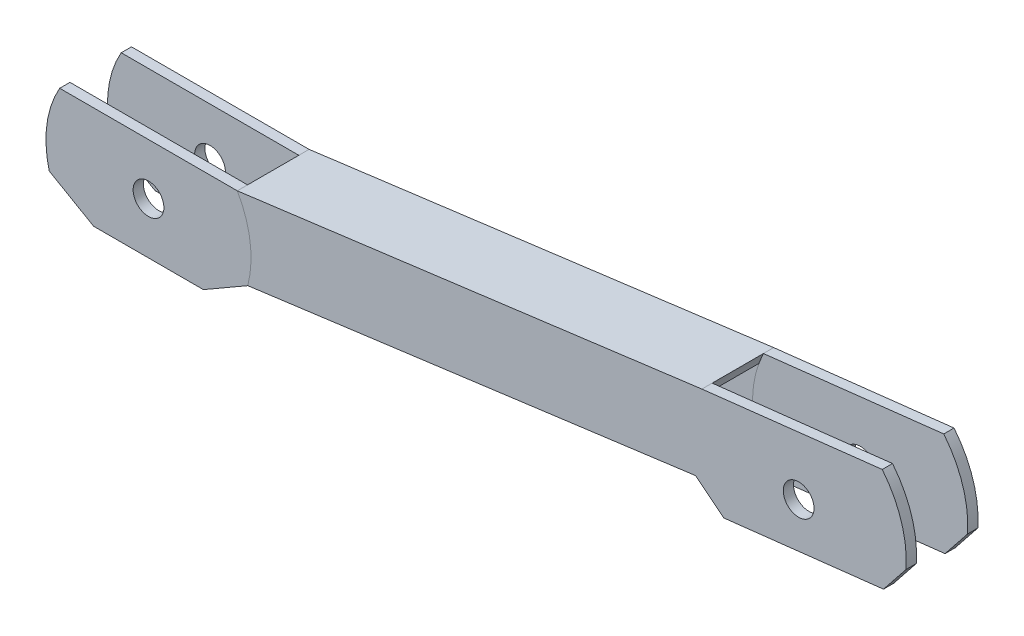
ISO-10303-21;
HEADER;
FILE_DESCRIPTION(('STEP AP214'),'2;1');
FILE_NAME('part.step','',(''),(''),'','','');
FILE_SCHEMA(('AUTOMOTIVE_DESIGN { 1 0 10303 214 1 1 1 1 }'));
ENDSEC;
DATA;
#1=APPLICATION_CONTEXT('core data for automotive mechanical design processes');
#2=APPLICATION_PROTOCOL_DEFINITION('international standard','automotive_design',2000,#1);
#3=PRODUCT_CONTEXT('',#1,'mechanical');
#4=PRODUCT('Part','Part','',(#3));
#5=PRODUCT_RELATED_PRODUCT_CATEGORY('part','',(#4));
#6=PRODUCT_DEFINITION_FORMATION('','',#4);
#7=PRODUCT_DEFINITION_CONTEXT('part definition',#1,'design');
#8=PRODUCT_DEFINITION('design','',#6,#7);
#9=PRODUCT_DEFINITION_SHAPE('','',#8);
#10=(LENGTH_UNIT() NAMED_UNIT(*) SI_UNIT(.MILLI.,.METRE.));
#11=(NAMED_UNIT(*) PLANE_ANGLE_UNIT() SI_UNIT($,.RADIAN.));
#12=(NAMED_UNIT(*) SI_UNIT($,.STERADIAN.) SOLID_ANGLE_UNIT());
#13=UNCERTAINTY_MEASURE_WITH_UNIT(LENGTH_MEASURE(1.E-05),#10,'distance_accuracy_value','');
#14=(GEOMETRIC_REPRESENTATION_CONTEXT(3) GLOBAL_UNCERTAINTY_ASSIGNED_CONTEXT((#13)) GLOBAL_UNIT_ASSIGNED_CONTEXT((#10,
#11,#12)) REPRESENTATION_CONTEXT('',''));
#15=CARTESIAN_POINT('',(0.,0.,0.));
#16=DIRECTION('',(0.,0.,1.));
#17=DIRECTION('',(1.,0.,0.));
#18=AXIS2_PLACEMENT_3D('',#15,#16,#17);
#19=CARTESIAN_POINT('',(634.,63.,35.));
#20=DIRECTION('',(0.,0.,-1.));
#21=DIRECTION('',(-1.,0.,0.));
#22=AXIS2_PLACEMENT_3D('',#19,#20,#21);
#23=CYLINDRICAL_SURFACE('',#22,105.);
#24=CARTESIAN_POINT('',(634.,63.,-25.));
#25=DIRECTION('',(0.,0.,1.));
#26=DIRECTION('',(1.,0.,0.));
#27=AXIS2_PLACEMENT_3D('',#24,#25,#26);
#28=CIRCLE('',#27,105.);
#29=CARTESIAN_POINT('',(539.670102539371,109.118005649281,-25.));
#30=VERTEX_POINT('',#29);
#31=CARTESIAN_POINT('',(533.401265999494,32.9185319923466,-25.));
#32=VERTEX_POINT('',#31);
#33=EDGE_CURVE('E74',#30,#32,#28,.T.);
#34=ORIENTED_EDGE('',*,*,#33,.F.);
#35=DIRECTION('',(0.,0.,-1.));
#36=VECTOR('',#35,1.);
#37=CARTESIAN_POINT('',(539.670102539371,109.118005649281,35.));
#38=LINE('',#37,#36);
#39=CARTESIAN_POINT('',(539.670102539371,109.118005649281,-35.));
#40=VERTEX_POINT('',#39);
#41=EDGE_CURVE('E48',#30,#40,#38,.T.);
#42=ORIENTED_EDGE('',*,*,#41,.T.);
#43=CARTESIAN_POINT('',(634.,63.,-35.));
#44=DIRECTION('',(0.,0.,1.));
#45=DIRECTION('',(1.,0.,0.));
#46=AXIS2_PLACEMENT_3D('',#43,#44,#45);
#47=CIRCLE('',#46,105.);
#48=CARTESIAN_POINT('',(533.401265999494,32.9185319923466,-35.));
#49=VERTEX_POINT('',#48);
#50=EDGE_CURVE('E112',#40,#49,#47,.T.);
#51=ORIENTED_EDGE('',*,*,#50,.T.);
#52=DIRECTION('',(0.,0.,-1.));
#53=VECTOR('',#52,1.);
#54=CARTESIAN_POINT('',(533.401265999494,32.9185319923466,35.));
#55=LINE('',#54,#53);
#56=EDGE_CURVE('E104',#32,#49,#55,.T.);
#57=ORIENTED_EDGE('',*,*,#56,.F.);
#58=EDGE_LOOP('',(#34,#42,#51,#57));
#59=FACE_BOUND('',#58,.T.);
#60=ADVANCED_FACE('F44',(#59),#23,.T.);
#61=CARTESIAN_POINT('',(533.401265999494,32.9185319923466,35.));
#62=DIRECTION('',(0.622514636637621,0.782608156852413,0.));
#63=DIRECTION('',(-0.782608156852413,0.622514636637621,0.));
#64=AXIS2_PLACEMENT_3D('',#61,#62,#63);
#65=PLANE('',#64);
#66=DIRECTION('',(0.782608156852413,-0.622514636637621,0.));
#67=VECTOR('',#66,1.);
#68=CARTESIAN_POINT('',(533.401265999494,32.9185319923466,-25.));
#69=LINE('',#68,#67);
#70=CARTESIAN_POINT('',(561.070642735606,10.9093159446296,-25.));
#71=VERTEX_POINT('',#70);
#72=EDGE_CURVE('E109',#32,#71,#69,.T.);
#73=ORIENTED_EDGE('',*,*,#72,.F.);
#74=ORIENTED_EDGE('',*,*,#56,.T.);
#75=DIRECTION('',(0.782608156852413,-0.622514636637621,0.));
#76=VECTOR('',#75,1.);
#77=CARTESIAN_POINT('',(533.401265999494,32.9185319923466,-35.));
#78=LINE('',#77,#76);
#79=CARTESIAN_POINT('',(561.070642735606,10.9093159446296,-35.));
#80=VERTEX_POINT('',#79);
#81=EDGE_CURVE('E107',#49,#80,#78,.T.);
#82=ORIENTED_EDGE('',*,*,#81,.T.);
#83=DIRECTION('',(0.,0.,-1.));
#84=VECTOR('',#83,1.);
#85=CARTESIAN_POINT('',(561.070642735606,10.9093159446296,35.));
#86=LINE('',#85,#84);
#87=EDGE_CURVE('E99',#71,#80,#86,.T.);
#88=ORIENTED_EDGE('',*,*,#87,.F.);
#89=EDGE_LOOP('',(#73,#74,#82,#88));
#90=FACE_BOUND('',#89,.T.);
#91=ADVANCED_FACE('F106',(#90),#65,.F.);
#92=CARTESIAN_POINT('',(561.070642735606,10.9093159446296,35.));
#93=DIRECTION('',(-0.113203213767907,0.993571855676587,0.));
#94=DIRECTION('',(-0.993571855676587,-0.113203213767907,0.));
#95=AXIS2_PLACEMENT_3D('',#92,#93,#94);
#96=PLANE('',#95);
#97=DIRECTION('',(0.993571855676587,0.113203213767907,0.));
#98=VECTOR('',#97,1.);
#99=CARTESIAN_POINT('',(561.070642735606,10.9093159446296,-25.));
#100=LINE('',#99,#98);
#101=CARTESIAN_POINT('',(716.778036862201,28.6499326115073,-25.));
#102=VERTEX_POINT('',#101);
#103=EDGE_CURVE('E54',#71,#102,#100,.T.);
#104=ORIENTED_EDGE('',*,*,#103,.F.);
#105=ORIENTED_EDGE('',*,*,#87,.T.);
#106=DIRECTION('',(0.993571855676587,0.113203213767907,0.));
#107=VECTOR('',#106,1.);
#108=CARTESIAN_POINT('',(561.070642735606,10.9093159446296,-35.));
#109=LINE('',#108,#107);
#110=CARTESIAN_POINT('',(716.778036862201,28.6499326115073,-35.));
#111=VERTEX_POINT('',#110);
#112=EDGE_CURVE('E120',#80,#111,#109,.T.);
#113=ORIENTED_EDGE('',*,*,#112,.T.);
#114=DIRECTION('',(0.,0.,-1.));
#115=VECTOR('',#114,1.);
#116=CARTESIAN_POINT('',(716.778036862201,28.6499326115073,35.));
#117=LINE('',#116,#115);
#118=EDGE_CURVE('E137',#102,#111,#117,.T.);
#119=ORIENTED_EDGE('',*,*,#118,.F.);
#120=EDGE_LOOP('',(#104,#105,#113,#119));
#121=FACE_BOUND('',#120,.T.);
#122=ADVANCED_FACE('F155',(#121),#96,.F.);
#123=CARTESIAN_POINT('',(738.787252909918,56.3193093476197,35.));
#124=DIRECTION('',(-0.782608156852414,0.622514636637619,0.));
#125=DIRECTION('',(-0.622514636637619,-0.782608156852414,0.));
#126=AXIS2_PLACEMENT_3D('',#123,#124,#125);
#127=PLANE('',#126);
#128=DIRECTION('',(0.622514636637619,0.782608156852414,0.));
#129=VECTOR('',#128,1.);
#130=CARTESIAN_POINT('',(716.778036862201,28.6499326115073,-25.));
#131=LINE('',#130,#129);
#132=CARTESIAN_POINT('',(738.787252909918,56.3193093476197,-25.));
#133=VERTEX_POINT('',#132);
#134=EDGE_CURVE('E12',#102,#133,#131,.T.);
#135=ORIENTED_EDGE('',*,*,#134,.F.);
#136=ORIENTED_EDGE('',*,*,#118,.T.);
#137=DIRECTION('',(0.622514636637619,0.782608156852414,0.));
#138=VECTOR('',#137,1.);
#139=CARTESIAN_POINT('',(738.787252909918,56.3193093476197,-35.));
#140=LINE('',#139,#138);
#141=CARTESIAN_POINT('',(738.787252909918,56.3193093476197,-35.));
#142=VERTEX_POINT('',#141);
#143=EDGE_CURVE('E139',#111,#142,#140,.T.);
#144=ORIENTED_EDGE('',*,*,#143,.T.);
#145=DIRECTION('',(0.,0.,-1.));
#146=VECTOR('',#145,1.);
#147=CARTESIAN_POINT('',(738.787252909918,56.3193093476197,35.));
#148=LINE('',#147,#146);
#149=EDGE_CURVE('E140',#133,#142,#148,.T.);
#150=ORIENTED_EDGE('',*,*,#149,.F.);
#151=EDGE_LOOP('',(#135,#136,#144,#150));
#152=FACE_BOUND('',#151,.T.);
#153=ADVANCED_FACE('F158',(#152),#127,.F.);
#154=CARTESIAN_POINT('',(634.,63.,35.));
#155=DIRECTION('',(0.,0.,-1.));
#156=DIRECTION('',(-1.,0.,0.));
#157=AXIS2_PLACEMENT_3D('',#154,#155,#156);
#158=CYLINDRICAL_SURFACE('',#157,105.);
#159=CARTESIAN_POINT('',(634.,63.,-25.));
#160=DIRECTION('',(0.,0.,1.));
#161=DIRECTION('',(1.,0.,0.));
#162=AXIS2_PLACEMENT_3D('',#159,#160,#161);
#163=CIRCLE('',#162,105.);
#164=CARTESIAN_POINT('',(715.537934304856,129.155614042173,-25.));
#165=VERTEX_POINT('',#164);
#166=EDGE_CURVE('E81',#133,#165,#163,.T.);
#167=ORIENTED_EDGE('',*,*,#166,.F.);
#168=ORIENTED_EDGE('',*,*,#149,.T.);
#169=CARTESIAN_POINT('',(634.,63.,-35.));
#170=DIRECTION('',(0.,0.,1.));
#171=DIRECTION('',(1.,0.,0.));
#172=AXIS2_PLACEMENT_3D('',#169,#170,#171);
#173=CIRCLE('',#172,105.);
#174=CARTESIAN_POINT('',(715.537934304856,129.155614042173,-35.));
#175=VERTEX_POINT('',#174);
#176=EDGE_CURVE('E141',#142,#175,#173,.T.);
#177=ORIENTED_EDGE('',*,*,#176,.T.);
#178=DIRECTION('',(0.,0.,-1.));
#179=VECTOR('',#178,1.);
#180=CARTESIAN_POINT('',(715.537934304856,129.155614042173,35.));
#181=LINE('',#180,#179);
#182=EDGE_CURVE('E142',#165,#175,#181,.T.);
#183=ORIENTED_EDGE('',*,*,#182,.F.);
#184=EDGE_LOOP('',(#167,#168,#177,#183));
#185=FACE_BOUND('',#184,.T.);
#186=ADVANCED_FACE('F159',(#185),#158,.T.);
#187=CARTESIAN_POINT('',(539.670102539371,109.118005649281,35.));
#188=DIRECTION('',(0.113203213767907,-0.993571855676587,0.));
#189=DIRECTION('',(0.993571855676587,0.113203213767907,0.));
#190=AXIS2_PLACEMENT_3D('',#187,#188,#189);
#191=PLANE('',#190);
#192=DIRECTION('',(-0.993571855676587,-0.113203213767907,0.));
#193=VECTOR('',#192,1.);
#194=CARTESIAN_POINT('',(715.537934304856,129.155614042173,-25.));
#195=LINE('',#194,#193);
#196=EDGE_CURVE('E78',#165,#30,#195,.T.);
#197=ORIENTED_EDGE('',*,*,#196,.F.);
#198=ORIENTED_EDGE('',*,*,#182,.T.);
#199=DIRECTION('',(-0.993571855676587,-0.113203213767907,0.));
#200=VECTOR('',#199,1.);
#201=CARTESIAN_POINT('',(539.670102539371,109.118005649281,-35.));
#202=LINE('',#201,#200);
#203=EDGE_CURVE('E143',#175,#40,#202,.T.);
#204=ORIENTED_EDGE('',*,*,#203,.T.);
#205=ORIENTED_EDGE('',*,*,#41,.F.);
#206=EDGE_LOOP('',(#197,#198,#204,#205));
#207=FACE_BOUND('',#206,.T.);
#208=ADVANCED_FACE('F161',(#207),#191,.F.);
#209=CARTESIAN_POINT('',(634.,63.,35.));
#210=DIRECTION('',(0.,0.,-1.));
#211=DIRECTION('',(-1.,0.,0.));
#212=AXIS2_PLACEMENT_3D('',#209,#210,#211);
#213=CYLINDRICAL_SURFACE('',#212,15.);
#214=CARTESIAN_POINT('',(634.,63.,-35.));
#215=DIRECTION('',(0.,0.,1.));
#216=DIRECTION('',(1.,0.,0.));
#217=AXIS2_PLACEMENT_3D('',#214,#215,#216);
#218=CIRCLE('',#217,15.);
#219=CARTESIAN_POINT('',(649.,63.,-35.));
#220=VERTEX_POINT('',#219);
#221=EDGE_CURVE('E127',#220,#220,#218,.T.);
#222=ORIENTED_EDGE('',*,*,#221,.F.);
#223=EDGE_LOOP('',(#222));
#224=FACE_BOUND('',#223,.T.);
#225=CARTESIAN_POINT('',(634.,63.,-25.));
#226=DIRECTION('',(0.,0.,1.));
#227=DIRECTION('',(1.,0.,0.));
#228=AXIS2_PLACEMENT_3D('',#225,#226,#227);
#229=CIRCLE('',#228,15.);
#230=CARTESIAN_POINT('',(649.,63.,-25.));
#231=VERTEX_POINT('',#230);
#232=EDGE_CURVE('E129',#231,#231,#229,.T.);
#233=ORIENTED_EDGE('',*,*,#232,.T.);
#234=EDGE_LOOP('',(#233));
#235=FACE_BOUND('',#234,.T.);
#236=ADVANCED_FACE('F46',(#224,#235),#213,.F.);
#237=CARTESIAN_POINT('',(634.,63.,-35.));
#238=DIRECTION('',(0.,0.,1.));
#239=DIRECTION('',(1.,0.,0.));
#240=AXIS2_PLACEMENT_3D('',#237,#238,#239);
#241=PLANE('',#240);
#242=ORIENTED_EDGE('',*,*,#50,.F.);
#243=ORIENTED_EDGE('',*,*,#203,.F.);
#244=ORIENTED_EDGE('',*,*,#176,.F.);
#245=ORIENTED_EDGE('',*,*,#143,.F.);
#246=ORIENTED_EDGE('',*,*,#112,.F.);
#247=ORIENTED_EDGE('',*,*,#81,.F.);
#248=EDGE_LOOP('',(#242,#243,#244,#245,#246,#247));
#249=FACE_BOUND('',#248,.T.);
#250=ORIENTED_EDGE('',*,*,#221,.T.);
#251=EDGE_LOOP('',(#250));
#252=FACE_BOUND('',#251,.T.);
#253=ADVANCED_FACE('F116',(#249,#252),#241,.F.);
#254=CARTESIAN_POINT('',(634.,63.,-25.));
#255=DIRECTION('',(0.,0.,1.));
#256=DIRECTION('',(1.,0.,0.));
#257=AXIS2_PLACEMENT_3D('',#254,#255,#256);
#258=PLANE('',#257);
#259=ORIENTED_EDGE('',*,*,#232,.F.);
#260=EDGE_LOOP('',(#259));
#261=FACE_BOUND('',#260,.T.);
#262=ORIENTED_EDGE('',*,*,#166,.T.);
#263=ORIENTED_EDGE('',*,*,#196,.T.);
#264=ORIENTED_EDGE('',*,*,#33,.T.);
#265=ORIENTED_EDGE('',*,*,#72,.T.);
#266=ORIENTED_EDGE('',*,*,#103,.T.);
#267=ORIENTED_EDGE('',*,*,#134,.T.);
#268=EDGE_LOOP('',(#262,#263,#264,#265,#266,#267));
#269=FACE_BOUND('',#268,.T.);
#270=ADVANCED_FACE('F211',(#261,#269),#258,.T.);
#271=CLOSED_SHELL('',(#60,#91,#122,#153,#186,#208,#236,#253,#270));
#272=MANIFOLD_SOLID_BREP('B2',#271);
#273=CARTESIAN_POINT('',(91.4126657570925,40.5428728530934,35.));
#274=DIRECTION('',(-0.129387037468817,0.991594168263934,0.));
#275=DIRECTION('',(-0.991594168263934,-0.129387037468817,0.));
#276=AXIS2_PLACEMENT_3D('',#273,#274,#275);
#277=PLANE('',#276);
#278=DIRECTION('',(-0.991594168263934,-0.129387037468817,0.));
#279=VECTOR('',#278,1.);
#280=CARTESIAN_POINT('',(91.4126657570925,40.5428728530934,-25.));
#281=LINE('',#280,#279);
#282=CARTESIAN_POINT('',(535.163583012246,98.445206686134,-25.));
#283=VERTEX_POINT('',#282);
#284=CARTESIAN_POINT('',(91.4126657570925,40.5428728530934,-25.));
#285=VERTEX_POINT('',#284);
#286=EDGE_CURVE('E319',#283,#285,#281,.T.);
#287=ORIENTED_EDGE('',*,*,#286,.F.);
#288=DIRECTION('',(0.,0.,-1.));
#289=VECTOR('',#288,1.);
#290=CARTESIAN_POINT('',(535.163583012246,98.445206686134,35.));
#291=LINE('',#290,#289);
#292=CARTESIAN_POINT('',(535.163583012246,98.445206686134,25.));
#293=VERTEX_POINT('',#292);
#294=EDGE_CURVE('E409',#293,#283,#291,.T.);
#295=ORIENTED_EDGE('',*,*,#294,.F.);
#296=DIRECTION('',(0.991594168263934,0.129387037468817,0.));
#297=VECTOR('',#296,1.);
#298=CARTESIAN_POINT('',(91.4126657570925,40.5428728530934,25.));
#299=LINE('',#298,#297);
#300=CARTESIAN_POINT('',(91.4126657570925,40.5428728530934,25.));
#301=VERTEX_POINT('',#300);
#302=EDGE_CURVE('E267',#301,#293,#299,.T.);
#303=ORIENTED_EDGE('',*,*,#302,.F.);
#304=DIRECTION('',(0.,0.,-1.));
#305=VECTOR('',#304,1.);
#306=CARTESIAN_POINT('',(91.4126657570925,40.5428728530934,35.));
#307=LINE('',#306,#305);
#308=EDGE_CURVE('E489',#301,#285,#307,.T.);
#309=ORIENTED_EDGE('',*,*,#308,.T.);
#310=EDGE_LOOP('',(#287,#295,#303,#309));
#311=FACE_BOUND('',#310,.T.);
#312=ADVANCED_FACE('F250',(#311),#277,.F.);
#313=CARTESIAN_POINT('',(634.,63.,35.));
#314=DIRECTION('',(0.,0.,-1.));
#315=DIRECTION('',(-1.,0.,0.));
#316=AXIS2_PLACEMENT_3D('',#313,#314,#315);
#317=CYLINDRICAL_SURFACE('',#316,105.);
#318=CARTESIAN_POINT('',(634.,63.,-35.));
#319=DIRECTION('',(0.,0.,-1.));
#320=DIRECTION('',(1.,0.,0.));
#321=AXIS2_PLACEMENT_3D('',#318,#319,#320);
#322=CIRCLE('',#321,105.);
#323=CARTESIAN_POINT('',(533.401265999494,32.9185319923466,-35.));
#324=VERTEX_POINT('',#323);
#325=CARTESIAN_POINT('',(539.670102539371,109.118005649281,-35.));
#326=VERTEX_POINT('',#325);
#327=EDGE_CURVE('E472',#324,#326,#322,.T.);
#328=ORIENTED_EDGE('',*,*,#327,.T.);
#329=DIRECTION('',(0.,0.,-1.));
#330=VECTOR('',#329,1.);
#331=CARTESIAN_POINT('',(539.670102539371,109.118005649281,35.));
#332=LINE('',#331,#330);
#333=CARTESIAN_POINT('',(539.670102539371,109.118005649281,25.));
#334=VERTEX_POINT('',#333);
#335=EDGE_CURVE('E484',#334,#326,#332,.T.);
#336=ORIENTED_EDGE('',*,*,#335,.F.);
#337=CARTESIAN_POINT('',(634.,63.,25.));
#338=DIRECTION('',(0.,0.,1.));
#339=DIRECTION('',(1.,0.,0.));
#340=AXIS2_PLACEMENT_3D('',#337,#338,#339);
#341=CIRCLE('',#340,105.);
#342=EDGE_CURVE('E432',#334,#293,#341,.T.);
#343=ORIENTED_EDGE('',*,*,#342,.T.);
#344=ORIENTED_EDGE('',*,*,#294,.T.);
#345=CARTESIAN_POINT('',(634.,63.,-25.));
#346=DIRECTION('',(0.,0.,-1.));
#347=DIRECTION('',(1.,0.,0.));
#348=AXIS2_PLACEMENT_3D('',#345,#346,#347);
#349=CIRCLE('',#348,105.);
#350=CARTESIAN_POINT('',(533.401265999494,32.9185319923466,-25.));
#351=VERTEX_POINT('',#350);
#352=EDGE_CURVE('E392',#351,#283,#349,.T.);
#353=ORIENTED_EDGE('',*,*,#352,.F.);
#354=DIRECTION('',(0.,0.,-1.));
#355=VECTOR('',#354,1.);
#356=CARTESIAN_POINT('',(533.401265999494,32.9185319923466,-25.));
#357=LINE('',#356,#355);
#358=EDGE_CURVE('E398',#351,#324,#357,.T.);
#359=ORIENTED_EDGE('',*,*,#358,.T.);
#360=EDGE_LOOP('',(#328,#336,#343,#344,#353,#359));
#361=FACE_BOUND('',#360,.T.);
#362=ADVANCED_FACE('F408',(#361),#317,.F.);
#363=CARTESIAN_POINT('',(-86.6025403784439,50.,35.));
#364=DIRECTION('',(0.,-1.,0.));
#365=DIRECTION('',(0.,0.,-1.));
#366=AXIS2_PLACEMENT_3D('',#363,#364,#365);
#367=PLANE('',#366);
#368=DIRECTION('',(-1.,0.,0.));
#369=VECTOR('',#368,1.);
#370=CARTESIAN_POINT('',(-86.6025403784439,50.,-25.));
#371=LINE('',#370,#369);
#372=CARTESIAN_POINT('',(86.6025403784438,50.,-25.));
#373=VERTEX_POINT('',#372);
#374=CARTESIAN_POINT('',(-86.6025403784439,50.,-25.));
#375=VERTEX_POINT('',#374);
#376=EDGE_CURVE('E42',#373,#375,#371,.T.);
#377=ORIENTED_EDGE('',*,*,#376,.F.);
#378=DIRECTION('',(0.,0.,-1.));
#379=VECTOR('',#378,1.);
#380=CARTESIAN_POINT('',(86.6025403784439,50.,35.));
#381=LINE('',#380,#379);
#382=CARTESIAN_POINT('',(86.6025403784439,50.,-35.));
#383=VERTEX_POINT('',#382);
#384=EDGE_CURVE('E506',#373,#383,#381,.T.);
#385=ORIENTED_EDGE('',*,*,#384,.T.);
#386=DIRECTION('',(-1.,0.,0.));
#387=VECTOR('',#386,1.);
#388=CARTESIAN_POINT('',(-86.6025403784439,50.,-35.));
#389=LINE('',#388,#387);
#390=CARTESIAN_POINT('',(-86.6025403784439,50.,-35.));
#391=VERTEX_POINT('',#390);
#392=EDGE_CURVE('E504',#383,#391,#389,.T.);
#393=ORIENTED_EDGE('',*,*,#392,.T.);
#394=DIRECTION('',(0.,0.,-1.));
#395=VECTOR('',#394,1.);
#396=CARTESIAN_POINT('',(-86.6025403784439,50.,35.));
#397=LINE('',#396,#395);
#398=EDGE_CURVE('E313',#375,#391,#397,.T.);
#399=ORIENTED_EDGE('',*,*,#398,.F.);
#400=EDGE_LOOP('',(#377,#385,#393,#399));
#401=FACE_BOUND('',#400,.T.);
#402=ADVANCED_FACE('F537',(#401),#367,.F.);
#403=CARTESIAN_POINT('',(0.,0.,35.));
#404=DIRECTION('',(0.,0.,-1.));
#405=DIRECTION('',(-1.,0.,0.));
#406=AXIS2_PLACEMENT_3D('',#403,#404,#405);
#407=CYLINDRICAL_SURFACE('',#406,100.);
#408=CARTESIAN_POINT('',(0.,0.,-25.));
#409=DIRECTION('',(0.,0.,1.));
#410=DIRECTION('',(1.,0.,0.));
#411=AXIS2_PLACEMENT_3D('',#408,#409,#410);
#412=CIRCLE('',#411,100.);
#413=CARTESIAN_POINT('',(-96.8245836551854,-25.,-25.));
#414=VERTEX_POINT('',#413);
#415=EDGE_CURVE('E287',#375,#414,#412,.T.);
#416=ORIENTED_EDGE('',*,*,#415,.F.);
#417=ORIENTED_EDGE('',*,*,#398,.T.);
#418=CARTESIAN_POINT('',(0.,0.,-35.));
#419=DIRECTION('',(0.,0.,1.));
#420=DIRECTION('',(1.,0.,0.));
#421=AXIS2_PLACEMENT_3D('',#418,#419,#420);
#422=CIRCLE('',#421,100.);
#423=CARTESIAN_POINT('',(-96.8245836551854,-25.,-35.));
#424=VERTEX_POINT('',#423);
#425=EDGE_CURVE('E502',#391,#424,#422,.T.);
#426=ORIENTED_EDGE('',*,*,#425,.T.);
#427=DIRECTION('',(0.,0.,-1.));
#428=VECTOR('',#427,1.);
#429=CARTESIAN_POINT('',(-96.8245836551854,-25.,35.));
#430=LINE('',#429,#428);
#431=EDGE_CURVE('E307',#414,#424,#430,.T.);
#432=ORIENTED_EDGE('',*,*,#431,.F.);
#433=EDGE_LOOP('',(#416,#417,#426,#432));
#434=FACE_BOUND('',#433,.T.);
#435=ADVANCED_FACE('F533',(#434),#407,.T.);
#436=CARTESIAN_POINT('',(-96.8245836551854,-25.,35.));
#437=DIRECTION('',(0.499999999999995,0.866025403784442,0.));
#438=DIRECTION('',(-0.866025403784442,0.499999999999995,0.));
#439=AXIS2_PLACEMENT_3D('',#436,#437,#438);
#440=PLANE('',#439);
#441=DIRECTION('',(0.866025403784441,-0.499999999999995,0.));
#442=VECTOR('',#441,1.);
#443=CARTESIAN_POINT('',(-96.8245836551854,-25.,-25.));
#444=LINE('',#443,#442);
#445=CARTESIAN_POINT('',(-53.5233134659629,-50.,-25.));
#446=VERTEX_POINT('',#445);
#447=EDGE_CURVE('E513',#414,#446,#444,.T.);
#448=ORIENTED_EDGE('',*,*,#447,.F.);
#449=ORIENTED_EDGE('',*,*,#431,.T.);
#450=DIRECTION('',(0.866025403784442,-0.499999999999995,0.));
#451=VECTOR('',#450,1.);
#452=CARTESIAN_POINT('',(-96.8245836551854,-25.,-35.));
#453=LINE('',#452,#451);
#454=CARTESIAN_POINT('',(-53.5233134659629,-50.,-35.));
#455=VERTEX_POINT('',#454);
#456=EDGE_CURVE('E500',#424,#455,#453,.T.);
#457=ORIENTED_EDGE('',*,*,#456,.T.);
#458=DIRECTION('',(0.,0.,-1.));
#459=VECTOR('',#458,1.);
#460=CARTESIAN_POINT('',(-53.5233134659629,-50.,35.));
#461=LINE('',#460,#459);
#462=EDGE_CURVE('E499',#446,#455,#461,.T.);
#463=ORIENTED_EDGE('',*,*,#462,.F.);
#464=EDGE_LOOP('',(#448,#449,#457,#463));
#465=FACE_BOUND('',#464,.T.);
#466=ADVANCED_FACE('F527',(#465),#440,.F.);
#467=CARTESIAN_POINT('',(-53.5233134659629,-50.,35.));
#468=DIRECTION('',(0.,1.,0.));
#469=DIRECTION('',(0.,0.,1.));
#470=AXIS2_PLACEMENT_3D('',#467,#468,#469);
#471=PLANE('',#470);
#472=DIRECTION('',(1.,0.,0.));
#473=VECTOR('',#472,1.);
#474=CARTESIAN_POINT('',(-53.5233134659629,-50.,-25.));
#475=LINE('',#474,#473);
#476=CARTESIAN_POINT('',(53.5233134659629,-50.,-25.));
#477=VERTEX_POINT('',#476);
#478=EDGE_CURVE('E511',#446,#477,#475,.T.);
#479=ORIENTED_EDGE('',*,*,#478,.F.);
#480=ORIENTED_EDGE('',*,*,#462,.T.);
#481=DIRECTION('',(1.,0.,0.));
#482=VECTOR('',#481,1.);
#483=CARTESIAN_POINT('',(-53.5233134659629,-50.,-35.));
#484=LINE('',#483,#482);
#485=CARTESIAN_POINT('',(53.5233134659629,-50.,-35.));
#486=VERTEX_POINT('',#485);
#487=EDGE_CURVE('E497',#455,#486,#484,.T.);
#488=ORIENTED_EDGE('',*,*,#487,.T.);
#489=DIRECTION('',(0.,0.,-1.));
#490=VECTOR('',#489,1.);
#491=CARTESIAN_POINT('',(53.5233134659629,-50.,35.));
#492=LINE('',#491,#490);
#493=EDGE_CURVE('E296',#477,#486,#492,.T.);
#494=ORIENTED_EDGE('',*,*,#493,.F.);
#495=EDGE_LOOP('',(#479,#480,#488,#494));
#496=FACE_BOUND('',#495,.T.);
#497=ADVANCED_FACE('F523',(#496),#471,.F.);
#498=CARTESIAN_POINT('',(96.8245836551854,-25.,35.));
#499=DIRECTION('',(-0.499999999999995,0.866025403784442,0.));
#500=DIRECTION('',(-0.866025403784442,-0.499999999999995,0.));
#501=AXIS2_PLACEMENT_3D('',#498,#499,#500);
#502=PLANE('',#501);
#503=DIRECTION('',(0.866025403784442,0.499999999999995,0.));
#504=VECTOR('',#503,1.);
#505=CARTESIAN_POINT('',(53.5233134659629,-50.,-25.));
#506=LINE('',#505,#504);
#507=CARTESIAN_POINT('',(96.8245836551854,-25.,-25.));
#508=VERTEX_POINT('',#507);
#509=EDGE_CURVE('E394',#477,#508,#506,.T.);
#510=ORIENTED_EDGE('',*,*,#509,.F.);
#511=ORIENTED_EDGE('',*,*,#493,.T.);
#512=DIRECTION('',(0.866025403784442,0.499999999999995,0.));
#513=VECTOR('',#512,1.);
#514=CARTESIAN_POINT('',(96.8245836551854,-25.,-35.));
#515=LINE('',#514,#513);
#516=CARTESIAN_POINT('',(96.8245836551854,-25.,-35.));
#517=VERTEX_POINT('',#516);
#518=EDGE_CURVE('E495',#486,#517,#515,.T.);
#519=ORIENTED_EDGE('',*,*,#518,.T.);
#520=DIRECTION('',(0.,0.,-1.));
#521=VECTOR('',#520,1.);
#522=CARTESIAN_POINT('',(96.8245836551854,-25.,35.));
#523=LINE('',#522,#521);
#524=EDGE_CURVE('E254',#508,#517,#523,.T.);
#525=ORIENTED_EDGE('',*,*,#524,.F.);
#526=EDGE_LOOP('',(#510,#511,#519,#525));
#527=FACE_BOUND('',#526,.T.);
#528=ADVANCED_FACE('F532',(#527),#502,.F.);
#529=CARTESIAN_POINT('',(0.,0.,35.));
#530=DIRECTION('',(0.,0.,-1.));
#531=DIRECTION('',(-1.,0.,0.));
#532=AXIS2_PLACEMENT_3D('',#529,#530,#531);
#533=CYLINDRICAL_SURFACE('',#532,15.);
#534=CARTESIAN_POINT('',(0.,0.,-35.));
#535=DIRECTION('',(0.,0.,1.));
#536=DIRECTION('',(1.,0.,0.));
#537=AXIS2_PLACEMENT_3D('',#534,#535,#536);
#538=CIRCLE('',#537,15.);
#539=CARTESIAN_POINT('',(15.,0.,-35.));
#540=VERTEX_POINT('',#539);
#541=EDGE_CURVE('E494',#540,#540,#538,.T.);
#542=ORIENTED_EDGE('',*,*,#541,.F.);
#543=EDGE_LOOP('',(#542));
#544=FACE_BOUND('',#543,.T.);
#545=CARTESIAN_POINT('',(0.,0.,-25.));
#546=DIRECTION('',(0.,0.,1.));
#547=DIRECTION('',(1.,0.,0.));
#548=AXIS2_PLACEMENT_3D('',#545,#546,#547);
#549=CIRCLE('',#548,15.);
#550=CARTESIAN_POINT('',(15.,0.,-25.));
#551=VERTEX_POINT('',#550);
#552=EDGE_CURVE('E491',#551,#551,#549,.T.);
#553=ORIENTED_EDGE('',*,*,#552,.T.);
#554=EDGE_LOOP('',(#553));
#555=FACE_BOUND('',#554,.T.);
#556=ADVANCED_FACE('F252',(#544,#555),#533,.F.);
#557=CARTESIAN_POINT('',(0.,0.,-35.));
#558=DIRECTION('',(0.,0.,1.));
#559=DIRECTION('',(1.,0.,0.));
#560=AXIS2_PLACEMENT_3D('',#557,#558,#559);
#561=PLANE('',#560);
#562=ORIENTED_EDGE('',*,*,#327,.F.);
#563=DIRECTION('',(0.991314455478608,0.131512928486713,0.));
#564=VECTOR('',#563,1.);
#565=CARTESIAN_POINT('',(96.8245836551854,-25.,-35.));
#566=LINE('',#565,#564);
#567=EDGE_CURVE('E403',#517,#324,#566,.T.);
#568=ORIENTED_EDGE('',*,*,#567,.F.);
#569=ORIENTED_EDGE('',*,*,#518,.F.);
#570=ORIENTED_EDGE('',*,*,#487,.F.);
#571=ORIENTED_EDGE('',*,*,#456,.F.);
#572=ORIENTED_EDGE('',*,*,#425,.F.);
#573=ORIENTED_EDGE('',*,*,#392,.F.);
#574=DIRECTION('',(-0.991594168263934,-0.129387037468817,0.));
#575=VECTOR('',#574,1.);
#576=CARTESIAN_POINT('',(86.6025403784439,50.,-35.));
#577=LINE('',#576,#575);
#578=EDGE_CURVE('E478',#326,#383,#577,.T.);
#579=ORIENTED_EDGE('',*,*,#578,.F.);
#580=EDGE_LOOP('',(#562,#568,#569,#570,#571,#572,#573,#579));
#581=FACE_BOUND('',#580,.T.);
#582=ORIENTED_EDGE('',*,*,#541,.T.);
#583=EDGE_LOOP('',(#582));
#584=FACE_BOUND('',#583,.T.);
#585=ADVANCED_FACE('F530',(#581,#584),#561,.F.);
#586=CARTESIAN_POINT('',(0.,0.,-25.));
#587=DIRECTION('',(0.,0.,1.));
#588=DIRECTION('',(1.,0.,0.));
#589=AXIS2_PLACEMENT_3D('',#586,#587,#588);
#590=PLANE('',#589);
#591=ORIENTED_EDGE('',*,*,#552,.F.);
#592=EDGE_LOOP('',(#591));
#593=FACE_BOUND('',#592,.T.);
#594=ORIENTED_EDGE('',*,*,#415,.T.);
#595=ORIENTED_EDGE('',*,*,#447,.T.);
#596=ORIENTED_EDGE('',*,*,#478,.T.);
#597=ORIENTED_EDGE('',*,*,#509,.T.);
#598=DIRECTION('',(0.991314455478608,0.131512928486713,0.));
#599=VECTOR('',#598,1.);
#600=CARTESIAN_POINT('',(96.8245836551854,-25.,-25.));
#601=LINE('',#600,#599);
#602=EDGE_CURVE('E388',#508,#351,#601,.T.);
#603=ORIENTED_EDGE('',*,*,#602,.T.);
#604=ORIENTED_EDGE('',*,*,#352,.T.);
#605=ORIENTED_EDGE('',*,*,#286,.T.);
#606=CARTESIAN_POINT('',(0.,0.,-25.));
#607=DIRECTION('',(0.,0.,1.));
#608=DIRECTION('',(1.,0.,0.));
#609=AXIS2_PLACEMENT_3D('',#606,#607,#608);
#610=CIRCLE('',#609,100.);
#611=EDGE_CURVE('E259',#285,#373,#610,.T.);
#612=ORIENTED_EDGE('',*,*,#611,.T.);
#613=ORIENTED_EDGE('',*,*,#376,.T.);
#614=EDGE_LOOP('',(#594,#595,#596,#597,#603,#604,#605,#612,#613));
#615=FACE_BOUND('',#614,.T.);
#616=ADVANCED_FACE('F390',(#593,#615),#590,.T.);
#617=CARTESIAN_POINT('',(0.,0.,35.));
#618=DIRECTION('',(0.,0.,-1.));
#619=DIRECTION('',(-1.,0.,0.));
#620=AXIS2_PLACEMENT_3D('',#617,#618,#619);
#621=CYLINDRICAL_SURFACE('',#620,100.);
#622=DIRECTION('',(0.,0.,-1.));
#623=VECTOR('',#622,1.);
#624=CARTESIAN_POINT('',(86.6025403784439,50.,35.));
#625=LINE('',#624,#623);
#626=CARTESIAN_POINT('',(86.6025403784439,50.,35.));
#627=VERTEX_POINT('',#626);
#628=EDGE_CURVE('E480',#627,#373,#625,.T.);
#629=ORIENTED_EDGE('',*,*,#628,.T.);
#630=ORIENTED_EDGE('',*,*,#611,.F.);
#631=ORIENTED_EDGE('',*,*,#308,.F.);
#632=CARTESIAN_POINT('',(0.,0.,25.));
#633=DIRECTION('',(0.,0.,-1.));
#634=DIRECTION('',(1.,0.,0.));
#635=AXIS2_PLACEMENT_3D('',#632,#633,#634);
#636=CIRCLE('',#635,100.);
#637=CARTESIAN_POINT('',(96.8245836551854,-25.,25.));
#638=VERTEX_POINT('',#637);
#639=EDGE_CURVE('E415',#301,#638,#636,.T.);
#640=ORIENTED_EDGE('',*,*,#639,.T.);
#641=DIRECTION('',(0.,0.,1.));
#642=VECTOR('',#641,1.);
#643=CARTESIAN_POINT('',(96.8245836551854,-25.,25.));
#644=LINE('',#643,#642);
#645=CARTESIAN_POINT('',(96.8245836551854,-25.,35.));
#646=VERTEX_POINT('',#645);
#647=EDGE_CURVE('E420',#638,#646,#644,.T.);
#648=ORIENTED_EDGE('',*,*,#647,.T.);
#649=CARTESIAN_POINT('',(0.,0.,35.));
#650=DIRECTION('',(0.,0.,-1.));
#651=DIRECTION('',(1.,0.,0.));
#652=AXIS2_PLACEMENT_3D('',#649,#650,#651);
#653=CIRCLE('',#652,100.);
#654=EDGE_CURVE('E475',#627,#646,#653,.T.);
#655=ORIENTED_EDGE('',*,*,#654,.F.);
#656=EDGE_LOOP('',(#629,#630,#631,#640,#648,#655));
#657=FACE_BOUND('',#656,.T.);
#658=ADVANCED_FACE('F546',(#657),#621,.F.);
#659=CARTESIAN_POINT('',(86.6025403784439,50.,35.));
#660=DIRECTION('',(0.129387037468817,-0.991594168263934,0.));
#661=DIRECTION('',(0.991594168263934,0.129387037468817,0.));
#662=AXIS2_PLACEMENT_3D('',#659,#660,#661);
#663=PLANE('',#662);
#664=ORIENTED_EDGE('',*,*,#384,.F.);
#665=ORIENTED_EDGE('',*,*,#628,.F.);
#666=DIRECTION('',(-0.991594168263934,-0.129387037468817,0.));
#667=VECTOR('',#666,1.);
#668=CARTESIAN_POINT('',(86.6025403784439,50.,35.));
#669=LINE('',#668,#667);
#670=CARTESIAN_POINT('',(539.670102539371,109.118005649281,35.));
#671=VERTEX_POINT('',#670);
#672=EDGE_CURVE('E477',#671,#627,#669,.T.);
#673=ORIENTED_EDGE('',*,*,#672,.F.);
#674=EDGE_CURVE('E485',#671,#334,#332,.T.);
#675=ORIENTED_EDGE('',*,*,#674,.T.);
#676=ORIENTED_EDGE('',*,*,#335,.T.);
#677=ORIENTED_EDGE('',*,*,#578,.T.);
#678=EDGE_LOOP('',(#664,#665,#673,#675,#676,#677));
#679=FACE_BOUND('',#678,.T.);
#680=ADVANCED_FACE('F541',(#679),#663,.F.);
#681=CARTESIAN_POINT('',(0.,0.,35.));
#682=DIRECTION('',(0.,0.,1.));
#683=DIRECTION('',(1.,0.,0.));
#684=AXIS2_PLACEMENT_3D('',#681,#682,#683);
#685=PLANE('',#684);
#686=DIRECTION('',(-0.993571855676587,-0.113203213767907,0.));
#687=VECTOR('',#686,1.);
#688=CARTESIAN_POINT('',(539.670102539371,109.118005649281,35.));
#689=LINE('',#688,#687);
#690=CARTESIAN_POINT('',(715.537934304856,129.155614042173,35.));
#691=VERTEX_POINT('',#690);
#692=EDGE_CURVE('E455',#691,#671,#689,.T.);
#693=ORIENTED_EDGE('',*,*,#692,.T.);
#694=ORIENTED_EDGE('',*,*,#672,.T.);
#695=ORIENTED_EDGE('',*,*,#654,.T.);
#696=DIRECTION('',(0.991314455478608,0.131512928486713,0.));
#697=VECTOR('',#696,1.);
#698=CARTESIAN_POINT('',(96.8245836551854,-25.,35.));
#699=LINE('',#698,#697);
#700=CARTESIAN_POINT('',(533.401265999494,32.9185319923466,35.));
#701=VERTEX_POINT('',#700);
#702=EDGE_CURVE('E414',#646,#701,#699,.T.);
#703=ORIENTED_EDGE('',*,*,#702,.T.);
#704=DIRECTION('',(0.782608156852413,-0.622514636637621,0.));
#705=VECTOR('',#704,1.);
#706=CARTESIAN_POINT('',(533.401265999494,32.9185319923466,35.));
#707=LINE('',#706,#705);
#708=CARTESIAN_POINT('',(561.070642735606,10.9093159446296,35.));
#709=VERTEX_POINT('',#708);
#710=EDGE_CURVE('E447',#701,#709,#707,.T.);
#711=ORIENTED_EDGE('',*,*,#710,.T.);
#712=DIRECTION('',(0.993571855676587,0.113203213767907,0.));
#713=VECTOR('',#712,1.);
#714=CARTESIAN_POINT('',(561.070642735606,10.9093159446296,35.));
#715=LINE('',#714,#713);
#716=CARTESIAN_POINT('',(716.778036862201,28.6499326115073,35.));
#717=VERTEX_POINT('',#716);
#718=EDGE_CURVE('E449',#709,#717,#715,.T.);
#719=ORIENTED_EDGE('',*,*,#718,.T.);
#720=DIRECTION('',(0.622514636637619,0.782608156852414,0.));
#721=VECTOR('',#720,1.);
#722=CARTESIAN_POINT('',(738.787252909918,56.3193093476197,35.));
#723=LINE('',#722,#721);
#724=CARTESIAN_POINT('',(738.787252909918,56.3193093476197,35.));
#725=VERTEX_POINT('',#724);
#726=EDGE_CURVE('E451',#717,#725,#723,.T.);
#727=ORIENTED_EDGE('',*,*,#726,.T.);
#728=CARTESIAN_POINT('',(634.,63.,35.));
#729=DIRECTION('',(0.,0.,1.));
#730=DIRECTION('',(1.,0.,0.));
#731=AXIS2_PLACEMENT_3D('',#728,#729,#730);
#732=CIRCLE('',#731,105.);
#733=EDGE_CURVE('E453',#725,#691,#732,.T.);
#734=ORIENTED_EDGE('',*,*,#733,.T.);
#735=EDGE_LOOP('',(#693,#694,#695,#703,#711,#719,#727,#734));
#736=FACE_BOUND('',#735,.T.);
#737=CARTESIAN_POINT('',(634.,63.,35.));
#738=DIRECTION('',(0.,0.,1.));
#739=DIRECTION('',(1.,0.,0.));
#740=AXIS2_PLACEMENT_3D('',#737,#738,#739);
#741=CIRCLE('',#740,15.);
#742=CARTESIAN_POINT('',(649.,63.,35.));
#743=VERTEX_POINT('',#742);
#744=EDGE_CURVE('E444',#743,#743,#741,.T.);
#745=ORIENTED_EDGE('',*,*,#744,.F.);
#746=EDGE_LOOP('',(#745));
#747=FACE_BOUND('',#746,.T.);
#748=ADVANCED_FACE('F551',(#736,#747),#685,.T.);
#749=CARTESIAN_POINT('',(539.670102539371,109.118005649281,35.));
#750=DIRECTION('',(0.113203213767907,-0.993571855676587,0.));
#751=DIRECTION('',(0.993571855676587,0.113203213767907,0.));
#752=AXIS2_PLACEMENT_3D('',#749,#750,#751);
#753=PLANE('',#752);
#754=DIRECTION('',(0.,0.,-1.));
#755=VECTOR('',#754,1.);
#756=CARTESIAN_POINT('',(715.537934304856,129.155614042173,35.));
#757=LINE('',#756,#755);
#758=CARTESIAN_POINT('',(715.537934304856,129.155614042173,25.));
#759=VERTEX_POINT('',#758);
#760=EDGE_CURVE('E458',#691,#759,#757,.T.);
#761=ORIENTED_EDGE('',*,*,#760,.T.);
#762=DIRECTION('',(-0.993571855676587,-0.113203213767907,0.));
#763=VECTOR('',#762,1.);
#764=CARTESIAN_POINT('',(715.537934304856,129.155614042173,25.));
#765=LINE('',#764,#763);
#766=EDGE_CURVE('E429',#759,#334,#765,.T.);
#767=ORIENTED_EDGE('',*,*,#766,.T.);
#768=ORIENTED_EDGE('',*,*,#674,.F.);
#769=ORIENTED_EDGE('',*,*,#692,.F.);
#770=EDGE_LOOP('',(#761,#767,#768,#769));
#771=FACE_BOUND('',#770,.T.);
#772=ADVANCED_FACE('F556',(#771),#753,.F.);
#773=CARTESIAN_POINT('',(634.,63.,35.));
#774=DIRECTION('',(0.,0.,-1.));
#775=DIRECTION('',(-1.,0.,0.));
#776=AXIS2_PLACEMENT_3D('',#773,#774,#775);
#777=CYLINDRICAL_SURFACE('',#776,105.);
#778=DIRECTION('',(0.,0.,-1.));
#779=VECTOR('',#778,1.);
#780=CARTESIAN_POINT('',(738.787252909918,56.3193093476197,35.));
#781=LINE('',#780,#779);
#782=CARTESIAN_POINT('',(738.787252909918,56.3193093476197,25.));
#783=VERTEX_POINT('',#782);
#784=EDGE_CURVE('E461',#725,#783,#781,.T.);
#785=ORIENTED_EDGE('',*,*,#784,.T.);
#786=CARTESIAN_POINT('',(634.,63.,25.));
#787=DIRECTION('',(0.,0.,1.));
#788=DIRECTION('',(1.,0.,0.));
#789=AXIS2_PLACEMENT_3D('',#786,#787,#788);
#790=CIRCLE('',#789,105.);
#791=EDGE_CURVE('E426',#783,#759,#790,.T.);
#792=ORIENTED_EDGE('',*,*,#791,.T.);
#793=ORIENTED_EDGE('',*,*,#760,.F.);
#794=ORIENTED_EDGE('',*,*,#733,.F.);
#795=EDGE_LOOP('',(#785,#792,#793,#794));
#796=FACE_BOUND('',#795,.T.);
#797=ADVANCED_FACE('F578',(#796),#777,.T.);
#798=CARTESIAN_POINT('',(738.787252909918,56.3193093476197,35.));
#799=DIRECTION('',(-0.782608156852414,0.622514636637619,0.));
#800=DIRECTION('',(-0.622514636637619,-0.782608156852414,0.));
#801=AXIS2_PLACEMENT_3D('',#798,#799,#800);
#802=PLANE('',#801);
#803=DIRECTION('',(0.,0.,-1.));
#804=VECTOR('',#803,1.);
#805=CARTESIAN_POINT('',(716.778036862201,28.6499326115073,35.));
#806=LINE('',#805,#804);
#807=CARTESIAN_POINT('',(716.778036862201,28.6499326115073,25.));
#808=VERTEX_POINT('',#807);
#809=EDGE_CURVE('E464',#717,#808,#806,.T.);
#810=ORIENTED_EDGE('',*,*,#809,.T.);
#811=DIRECTION('',(0.622514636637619,0.782608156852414,0.));
#812=VECTOR('',#811,1.);
#813=CARTESIAN_POINT('',(716.778036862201,28.6499326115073,25.));
#814=LINE('',#813,#812);
#815=EDGE_CURVE('E440',#808,#783,#814,.T.);
#816=ORIENTED_EDGE('',*,*,#815,.T.);
#817=ORIENTED_EDGE('',*,*,#784,.F.);
#818=ORIENTED_EDGE('',*,*,#726,.F.);
#819=EDGE_LOOP('',(#810,#816,#817,#818));
#820=FACE_BOUND('',#819,.T.);
#821=ADVANCED_FACE('F574',(#820),#802,.F.);
#822=CARTESIAN_POINT('',(561.070642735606,10.9093159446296,35.));
#823=DIRECTION('',(-0.113203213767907,0.993571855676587,0.));
#824=DIRECTION('',(-0.993571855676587,-0.113203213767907,0.));
#825=AXIS2_PLACEMENT_3D('',#822,#823,#824);
#826=PLANE('',#825);
#827=DIRECTION('',(0.,0.,-1.));
#828=VECTOR('',#827,1.);
#829=CARTESIAN_POINT('',(561.070642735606,10.9093159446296,35.));
#830=LINE('',#829,#828);
#831=CARTESIAN_POINT('',(561.070642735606,10.9093159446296,25.));
#832=VERTEX_POINT('',#831);
#833=EDGE_CURVE('E467',#709,#832,#830,.T.);
#834=ORIENTED_EDGE('',*,*,#833,.T.);
#835=DIRECTION('',(0.993571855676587,0.113203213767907,0.));
#836=VECTOR('',#835,1.);
#837=CARTESIAN_POINT('',(561.070642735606,10.9093159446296,25.));
#838=LINE('',#837,#836);
#839=EDGE_CURVE('E437',#832,#808,#838,.T.);
#840=ORIENTED_EDGE('',*,*,#839,.T.);
#841=ORIENTED_EDGE('',*,*,#809,.F.);
#842=ORIENTED_EDGE('',*,*,#718,.F.);
#843=EDGE_LOOP('',(#834,#840,#841,#842));
#844=FACE_BOUND('',#843,.T.);
#845=ADVANCED_FACE('F570',(#844),#826,.F.);
#846=CARTESIAN_POINT('',(533.401265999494,32.9185319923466,35.));
#847=DIRECTION('',(0.622514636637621,0.782608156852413,0.));
#848=DIRECTION('',(-0.782608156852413,0.622514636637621,0.));
#849=AXIS2_PLACEMENT_3D('',#846,#847,#848);
#850=PLANE('',#849);
#851=DIRECTION('',(0.,0.,-1.));
#852=VECTOR('',#851,1.);
#853=CARTESIAN_POINT('',(533.401265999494,32.9185319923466,35.));
#854=LINE('',#853,#852);
#855=CARTESIAN_POINT('',(533.401265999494,32.9185319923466,25.));
#856=VERTEX_POINT('',#855);
#857=EDGE_CURVE('E470',#701,#856,#854,.T.);
#858=ORIENTED_EDGE('',*,*,#857,.T.);
#859=DIRECTION('',(0.782608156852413,-0.622514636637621,0.));
#860=VECTOR('',#859,1.);
#861=CARTESIAN_POINT('',(533.401265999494,32.9185319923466,25.));
#862=LINE('',#861,#860);
#863=EDGE_CURVE('E434',#856,#832,#862,.T.);
#864=ORIENTED_EDGE('',*,*,#863,.T.);
#865=ORIENTED_EDGE('',*,*,#833,.F.);
#866=ORIENTED_EDGE('',*,*,#710,.F.);
#867=EDGE_LOOP('',(#858,#864,#865,#866));
#868=FACE_BOUND('',#867,.T.);
#869=ADVANCED_FACE('F566',(#868),#850,.F.);
#870=CARTESIAN_POINT('',(634.,63.,35.));
#871=DIRECTION('',(0.,0.,-1.));
#872=DIRECTION('',(-1.,0.,0.));
#873=AXIS2_PLACEMENT_3D('',#870,#871,#872);
#874=CYLINDRICAL_SURFACE('',#873,15.);
#875=CARTESIAN_POINT('',(634.,63.,25.));
#876=DIRECTION('',(0.,0.,1.));
#877=DIRECTION('',(1.,0.,0.));
#878=AXIS2_PLACEMENT_3D('',#875,#876,#877);
#879=CIRCLE('',#878,15.);
#880=CARTESIAN_POINT('',(649.,63.,25.));
#881=VERTEX_POINT('',#880);
#882=EDGE_CURVE('E443',#881,#881,#879,.T.);
#883=ORIENTED_EDGE('',*,*,#882,.F.);
#884=EDGE_LOOP('',(#883));
#885=FACE_BOUND('',#884,.T.);
#886=ORIENTED_EDGE('',*,*,#744,.T.);
#887=EDGE_LOOP('',(#886));
#888=FACE_BOUND('',#887,.T.);
#889=ADVANCED_FACE('F691',(#885,#888),#874,.F.);
#890=CARTESIAN_POINT('',(634.,63.,25.));
#891=DIRECTION('',(0.,0.,1.));
#892=DIRECTION('',(1.,0.,0.));
#893=AXIS2_PLACEMENT_3D('',#890,#891,#892);
#894=PLANE('',#893);
#895=ORIENTED_EDGE('',*,*,#882,.T.);
#896=EDGE_LOOP('',(#895));
#897=FACE_BOUND('',#896,.T.);
#898=ORIENTED_EDGE('',*,*,#791,.F.);
#899=ORIENTED_EDGE('',*,*,#815,.F.);
#900=ORIENTED_EDGE('',*,*,#839,.F.);
#901=ORIENTED_EDGE('',*,*,#863,.F.);
#902=DIRECTION('',(0.991314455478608,0.131512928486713,0.));
#903=VECTOR('',#902,1.);
#904=CARTESIAN_POINT('',(96.8245836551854,-25.,25.));
#905=LINE('',#904,#903);
#906=EDGE_CURVE('E417',#638,#856,#905,.T.);
#907=ORIENTED_EDGE('',*,*,#906,.F.);
#908=ORIENTED_EDGE('',*,*,#639,.F.);
#909=ORIENTED_EDGE('',*,*,#302,.T.);
#910=ORIENTED_EDGE('',*,*,#342,.F.);
#911=ORIENTED_EDGE('',*,*,#766,.F.);
#912=EDGE_LOOP('',(#898,#899,#900,#901,#907,#908,#909,#910,#911));
#913=FACE_BOUND('',#912,.T.);
#914=ADVANCED_FACE('F559',(#897,#913),#894,.F.);
#915=CARTESIAN_POINT('',(96.8245836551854,-25.,25.));
#916=DIRECTION('',(0.131512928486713,-0.991314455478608,0.));
#917=DIRECTION('',(0.991314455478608,0.131512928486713,0.));
#918=AXIS2_PLACEMENT_3D('',#915,#916,#917);
#919=PLANE('',#918);
#920=ORIENTED_EDGE('',*,*,#702,.F.);
#921=ORIENTED_EDGE('',*,*,#647,.F.);
#922=ORIENTED_EDGE('',*,*,#906,.T.);
#923=ORIENTED_EDGE('',*,*,#857,.F.);
#924=EDGE_LOOP('',(#920,#921,#922,#923));
#925=FACE_BOUND('',#924,.T.);
#926=ADVANCED_FACE('F563',(#925),#919,.T.);
#927=CARTESIAN_POINT('',(96.8245836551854,-25.,-25.));
#928=DIRECTION('',(-0.131512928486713,0.991314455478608,0.));
#929=DIRECTION('',(-0.991314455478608,-0.131512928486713,0.));
#930=AXIS2_PLACEMENT_3D('',#927,#928,#929);
#931=PLANE('',#930);
#932=ORIENTED_EDGE('',*,*,#567,.T.);
#933=ORIENTED_EDGE('',*,*,#358,.F.);
#934=ORIENTED_EDGE('',*,*,#602,.F.);
#935=ORIENTED_EDGE('',*,*,#524,.T.);
#936=EDGE_LOOP('',(#932,#933,#934,#935));
#937=FACE_BOUND('',#936,.T.);
#938=ADVANCED_FACE('F402',(#937),#931,.F.);
#939=CLOSED_SHELL('',(#312,#362,#402,#435,#466,#497,#528,#556,#585,#616,#658,#680,#748,#772,
#797,#821,#845,#869,#889,#914,#926,#938));
#940=MANIFOLD_SOLID_BREP('B6',#939);
#941=CARTESIAN_POINT('',(96.8245836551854,-25.,35.));
#942=DIRECTION('',(-0.499999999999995,0.866025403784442,0.));
#943=DIRECTION('',(-0.866025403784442,-0.499999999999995,0.));
#944=AXIS2_PLACEMENT_3D('',#941,#942,#943);
#945=PLANE('',#944);
#946=DIRECTION('',(0.,0.,-1.));
#947=VECTOR('',#946,1.);
#948=CARTESIAN_POINT('',(53.5233134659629,-50.,35.));
#949=LINE('',#948,#947);
#950=CARTESIAN_POINT('',(53.5233134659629,-50.,35.));
#951=VERTEX_POINT('',#950);
#952=CARTESIAN_POINT('',(53.5233134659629,-50.,25.));
#953=VERTEX_POINT('',#952);
#954=EDGE_CURVE('E870',#951,#953,#949,.T.);
#955=ORIENTED_EDGE('',*,*,#954,.T.);
#956=DIRECTION('',(0.866025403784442,0.499999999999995,0.));
#957=VECTOR('',#956,1.);
#958=CARTESIAN_POINT('',(53.5233134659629,-50.,25.));
#959=LINE('',#958,#957);
#960=CARTESIAN_POINT('',(96.8245836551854,-25.,25.));
#961=VERTEX_POINT('',#960);
#962=EDGE_CURVE('E894',#953,#961,#959,.T.);
#963=ORIENTED_EDGE('',*,*,#962,.T.);
#964=DIRECTION('',(0.,0.,-1.));
#965=VECTOR('',#964,1.);
#966=CARTESIAN_POINT('',(96.8245836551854,-25.,35.));
#967=LINE('',#966,#965);
#968=CARTESIAN_POINT('',(96.8245836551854,-25.,35.));
#969=VERTEX_POINT('',#968);
#970=EDGE_CURVE('E875',#969,#961,#967,.T.);
#971=ORIENTED_EDGE('',*,*,#970,.F.);
#972=DIRECTION('',(0.866025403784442,0.499999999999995,0.));
#973=VECTOR('',#972,1.);
#974=CARTESIAN_POINT('',(96.8245836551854,-25.,35.));
#975=LINE('',#974,#973);
#976=EDGE_CURVE('E815',#951,#969,#975,.T.);
#977=ORIENTED_EDGE('',*,*,#976,.F.);
#978=EDGE_LOOP('',(#955,#963,#971,#977));
#979=FACE_BOUND('',#978,.T.);
#980=ADVANCED_FACE('F791',(#979),#945,.F.);
#981=CARTESIAN_POINT('',(-53.5233134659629,-50.,35.));
#982=DIRECTION('',(0.,1.,0.));
#983=DIRECTION('',(0.,0.,1.));
#984=AXIS2_PLACEMENT_3D('',#981,#982,#983);
#985=PLANE('',#984);
#986=DIRECTION('',(0.,0.,-1.));
#987=VECTOR('',#986,1.);
#988=CARTESIAN_POINT('',(-53.5233134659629,-50.,35.));
#989=LINE('',#988,#987);
#990=CARTESIAN_POINT('',(-53.5233134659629,-50.,35.));
#991=VERTEX_POINT('',#990);
#992=CARTESIAN_POINT('',(-53.5233134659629,-50.,25.));
#993=VERTEX_POINT('',#992);
#994=EDGE_CURVE('E867',#991,#993,#989,.T.);
#995=ORIENTED_EDGE('',*,*,#994,.T.);
#996=DIRECTION('',(1.,0.,0.));
#997=VECTOR('',#996,1.);
#998=CARTESIAN_POINT('',(-53.5233134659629,-50.,25.));
#999=LINE('',#998,#997);
#1000=EDGE_CURVE('E850',#993,#953,#999,.T.);
#1001=ORIENTED_EDGE('',*,*,#1000,.T.);
#1002=ORIENTED_EDGE('',*,*,#954,.F.);
#1003=DIRECTION('',(1.,0.,0.));
#1004=VECTOR('',#1003,1.);
#1005=CARTESIAN_POINT('',(-53.5233134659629,-50.,35.));
#1006=LINE('',#1005,#1004);
#1007=EDGE_CURVE('E879',#991,#951,#1006,.T.);
#1008=ORIENTED_EDGE('',*,*,#1007,.F.);
#1009=EDGE_LOOP('',(#995,#1001,#1002,#1008));
#1010=FACE_BOUND('',#1009,.T.);
#1011=ADVANCED_FACE('F898',(#1010),#985,.F.);
#1012=CARTESIAN_POINT('',(-96.8245836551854,-25.,35.));
#1013=DIRECTION('',(0.499999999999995,0.866025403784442,0.));
#1014=DIRECTION('',(-0.866025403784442,0.499999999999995,0.));
#1015=AXIS2_PLACEMENT_3D('',#1012,#1013,#1014);
#1016=PLANE('',#1015);
#1017=DIRECTION('',(0.,0.,-1.));
#1018=VECTOR('',#1017,1.);
#1019=CARTESIAN_POINT('',(-96.8245836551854,-25.,35.));
#1020=LINE('',#1019,#1018);
#1021=CARTESIAN_POINT('',(-96.8245836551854,-25.,35.));
#1022=VERTEX_POINT('',#1021);
#1023=CARTESIAN_POINT('',(-96.8245836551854,-25.,25.));
#1024=VERTEX_POINT('',#1023);
#1025=EDGE_CURVE('E861',#1022,#1024,#1020,.T.);
#1026=ORIENTED_EDGE('',*,*,#1025,.T.);
#1027=DIRECTION('',(0.866025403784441,-0.499999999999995,0.));
#1028=VECTOR('',#1027,1.);
#1029=CARTESIAN_POINT('',(-96.8245836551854,-25.,25.));
#1030=LINE('',#1029,#1028);
#1031=EDGE_CURVE('E844',#1024,#993,#1030,.T.);
#1032=ORIENTED_EDGE('',*,*,#1031,.T.);
#1033=ORIENTED_EDGE('',*,*,#994,.F.);
#1034=DIRECTION('',(0.866025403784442,-0.499999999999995,0.));
#1035=VECTOR('',#1034,1.);
#1036=CARTESIAN_POINT('',(-96.8245836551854,-25.,35.));
#1037=LINE('',#1036,#1035);
#1038=EDGE_CURVE('E866',#1022,#991,#1037,.T.);
#1039=ORIENTED_EDGE('',*,*,#1038,.F.);
#1040=EDGE_LOOP('',(#1026,#1032,#1033,#1039));
#1041=FACE_BOUND('',#1040,.T.);
#1042=ADVANCED_FACE('F865',(#1041),#1016,.F.);
#1043=CARTESIAN_POINT('',(0.,0.,35.));
#1044=DIRECTION('',(0.,0.,-1.));
#1045=DIRECTION('',(-1.,0.,0.));
#1046=AXIS2_PLACEMENT_3D('',#1043,#1044,#1045);
#1047=CYLINDRICAL_SURFACE('',#1046,100.);
#1048=DIRECTION('',(0.,0.,-1.));
#1049=VECTOR('',#1048,1.);
#1050=CARTESIAN_POINT('',(-86.6025403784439,50.,35.));
#1051=LINE('',#1050,#1049);
#1052=CARTESIAN_POINT('',(-86.6025403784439,50.,35.));
#1053=VERTEX_POINT('',#1052);
#1054=CARTESIAN_POINT('',(-86.6025403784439,50.,25.));
#1055=VERTEX_POINT('',#1054);
#1056=EDGE_CURVE('E800',#1053,#1055,#1051,.T.);
#1057=ORIENTED_EDGE('',*,*,#1056,.T.);
#1058=CARTESIAN_POINT('',(0.,0.,25.));
#1059=DIRECTION('',(0.,0.,1.));
#1060=DIRECTION('',(1.,0.,0.));
#1061=AXIS2_PLACEMENT_3D('',#1058,#1059,#1060);
#1062=CIRCLE('',#1061,100.);
#1063=EDGE_CURVE('E847',#1055,#1024,#1062,.T.);
#1064=ORIENTED_EDGE('',*,*,#1063,.T.);
#1065=ORIENTED_EDGE('',*,*,#1025,.F.);
#1066=CARTESIAN_POINT('',(0.,0.,35.));
#1067=DIRECTION('',(0.,0.,1.));
#1068=DIRECTION('',(1.,0.,0.));
#1069=AXIS2_PLACEMENT_3D('',#1066,#1067,#1068);
#1070=CIRCLE('',#1069,100.);
#1071=EDGE_CURVE('E882',#1053,#1022,#1070,.T.);
#1072=ORIENTED_EDGE('',*,*,#1071,.F.);
#1073=EDGE_LOOP('',(#1057,#1064,#1065,#1072));
#1074=FACE_BOUND('',#1073,.T.);
#1075=ADVANCED_FACE('F859',(#1074),#1047,.T.);
#1076=CARTESIAN_POINT('',(-86.6025403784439,50.,35.));
#1077=DIRECTION('',(0.,-1.,0.));
#1078=DIRECTION('',(0.,0.,-1.));
#1079=AXIS2_PLACEMENT_3D('',#1076,#1077,#1078);
#1080=PLANE('',#1079);
#1081=DIRECTION('',(0.,0.,-1.));
#1082=VECTOR('',#1081,1.);
#1083=CARTESIAN_POINT('',(86.6025403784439,50.,35.));
#1084=LINE('',#1083,#1082);
#1085=CARTESIAN_POINT('',(86.6025403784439,50.,35.));
#1086=VERTEX_POINT('',#1085);
#1087=CARTESIAN_POINT('',(86.6025403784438,50.,25.));
#1088=VERTEX_POINT('',#1087);
#1089=EDGE_CURVE('E248',#1086,#1088,#1084,.T.);
#1090=ORIENTED_EDGE('',*,*,#1089,.T.);
#1091=DIRECTION('',(-1.,0.,0.));
#1092=VECTOR('',#1091,1.);
#1093=CARTESIAN_POINT('',(-86.6025403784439,50.,25.));
#1094=LINE('',#1093,#1092);
#1095=EDGE_CURVE('E891',#1088,#1055,#1094,.T.);
#1096=ORIENTED_EDGE('',*,*,#1095,.T.);
#1097=ORIENTED_EDGE('',*,*,#1056,.F.);
#1098=DIRECTION('',(-1.,0.,0.));
#1099=VECTOR('',#1098,1.);
#1100=CARTESIAN_POINT('',(-86.6025403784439,50.,35.));
#1101=LINE('',#1100,#1099);
#1102=EDGE_CURVE('E884',#1086,#1053,#1101,.T.);
#1103=ORIENTED_EDGE('',*,*,#1102,.F.);
#1104=EDGE_LOOP('',(#1090,#1096,#1097,#1103));
#1105=FACE_BOUND('',#1104,.T.);
#1106=ADVANCED_FACE('F907',(#1105),#1080,.F.);
#1107=CARTESIAN_POINT('',(0.,0.,35.));
#1108=DIRECTION('',(0.,0.,-1.));
#1109=DIRECTION('',(-1.,0.,0.));
#1110=AXIS2_PLACEMENT_3D('',#1107,#1108,#1109);
#1111=CYLINDRICAL_SURFACE('',#1110,100.);
#1112=ORIENTED_EDGE('',*,*,#970,.T.);
#1113=CARTESIAN_POINT('',(0.,0.,25.));
#1114=DIRECTION('',(0.,0.,1.));
#1115=DIRECTION('',(1.,0.,0.));
#1116=AXIS2_PLACEMENT_3D('',#1113,#1114,#1115);
#1117=CIRCLE('',#1116,100.);
#1118=EDGE_CURVE('E807',#961,#1088,#1117,.T.);
#1119=ORIENTED_EDGE('',*,*,#1118,.T.);
#1120=ORIENTED_EDGE('',*,*,#1089,.F.);
#1121=CARTESIAN_POINT('',(0.,0.,35.));
#1122=DIRECTION('',(0.,0.,1.));
#1123=DIRECTION('',(1.,0.,0.));
#1124=AXIS2_PLACEMENT_3D('',#1121,#1122,#1123);
#1125=CIRCLE('',#1124,100.);
#1126=EDGE_CURVE('E886',#969,#1086,#1125,.T.);
#1127=ORIENTED_EDGE('',*,*,#1126,.F.);
#1128=EDGE_LOOP('',(#1112,#1119,#1120,#1127));
#1129=FACE_BOUND('',#1128,.T.);
#1130=ADVANCED_FACE('F793',(#1129),#1111,.T.);
#1131=CARTESIAN_POINT('',(0.,0.,35.));
#1132=DIRECTION('',(0.,0.,1.));
#1133=DIRECTION('',(1.,0.,0.));
#1134=AXIS2_PLACEMENT_3D('',#1131,#1132,#1133);
#1135=PLANE('',#1134);
#1136=ORIENTED_EDGE('',*,*,#1126,.T.);
#1137=ORIENTED_EDGE('',*,*,#1102,.T.);
#1138=ORIENTED_EDGE('',*,*,#1071,.T.);
#1139=ORIENTED_EDGE('',*,*,#1038,.T.);
#1140=ORIENTED_EDGE('',*,*,#1007,.T.);
#1141=ORIENTED_EDGE('',*,*,#976,.T.);
#1142=EDGE_LOOP('',(#1136,#1137,#1138,#1139,#1140,#1141));
#1143=FACE_BOUND('',#1142,.T.);
#1144=CARTESIAN_POINT('',(0.,0.,35.));
#1145=DIRECTION('',(0.,0.,1.));
#1146=DIRECTION('',(1.,0.,0.));
#1147=AXIS2_PLACEMENT_3D('',#1144,#1145,#1146);
#1148=CIRCLE('',#1147,15.);
#1149=CARTESIAN_POINT('',(15.,0.,35.));
#1150=VERTEX_POINT('',#1149);
#1151=EDGE_CURVE('E888',#1150,#1150,#1148,.T.);
#1152=ORIENTED_EDGE('',*,*,#1151,.F.);
#1153=EDGE_LOOP('',(#1152));
#1154=FACE_BOUND('',#1153,.T.);
#1155=ADVANCED_FACE('F904',(#1143,#1154),#1135,.T.);
#1156=CARTESIAN_POINT('',(0.,0.,35.));
#1157=DIRECTION('',(0.,0.,-1.));
#1158=DIRECTION('',(-1.,0.,0.));
#1159=AXIS2_PLACEMENT_3D('',#1156,#1157,#1158);
#1160=CYLINDRICAL_SURFACE('',#1159,15.);
#1161=CARTESIAN_POINT('',(0.,0.,25.));
#1162=DIRECTION('',(0.,0.,1.));
#1163=DIRECTION('',(1.,0.,0.));
#1164=AXIS2_PLACEMENT_3D('',#1161,#1162,#1163);
#1165=CIRCLE('',#1164,15.);
#1166=CARTESIAN_POINT('',(15.,0.,25.));
#1167=VERTEX_POINT('',#1166);
#1168=EDGE_CURVE('E795',#1167,#1167,#1165,.T.);
#1169=ORIENTED_EDGE('',*,*,#1168,.F.);
#1170=EDGE_LOOP('',(#1169));
#1171=FACE_BOUND('',#1170,.T.);
#1172=ORIENTED_EDGE('',*,*,#1151,.T.);
#1173=EDGE_LOOP('',(#1172));
#1174=FACE_BOUND('',#1173,.T.);
#1175=ADVANCED_FACE('F949',(#1171,#1174),#1160,.F.);
#1176=CARTESIAN_POINT('',(0.,0.,25.));
#1177=DIRECTION('',(0.,0.,1.));
#1178=DIRECTION('',(1.,0.,0.));
#1179=AXIS2_PLACEMENT_3D('',#1176,#1177,#1178);
#1180=PLANE('',#1179);
#1181=ORIENTED_EDGE('',*,*,#1168,.T.);
#1182=EDGE_LOOP('',(#1181));
#1183=FACE_BOUND('',#1182,.T.);
#1184=ORIENTED_EDGE('',*,*,#1063,.F.);
#1185=ORIENTED_EDGE('',*,*,#1095,.F.);
#1186=ORIENTED_EDGE('',*,*,#1118,.F.);
#1187=ORIENTED_EDGE('',*,*,#962,.F.);
#1188=ORIENTED_EDGE('',*,*,#1000,.F.);
#1189=ORIENTED_EDGE('',*,*,#1031,.F.);
#1190=EDGE_LOOP('',(#1184,#1185,#1186,#1187,#1188,#1189));
#1191=FACE_BOUND('',#1190,.T.);
#1192=ADVANCED_FACE('F846',(#1183,#1191),#1180,.F.);
#1193=CLOSED_SHELL('',(#980,#1011,#1042,#1075,#1106,#1130,#1155,#1175,#1192));
#1194=MANIFOLD_SOLID_BREP('B36',#1193);
#1195=ADVANCED_BREP_SHAPE_REPRESENTATION('',(#18,#272,#940,#1194),#14);
#1196=SHAPE_DEFINITION_REPRESENTATION(#9,#1195);
ENDSEC;
END-ISO-10303-21;
